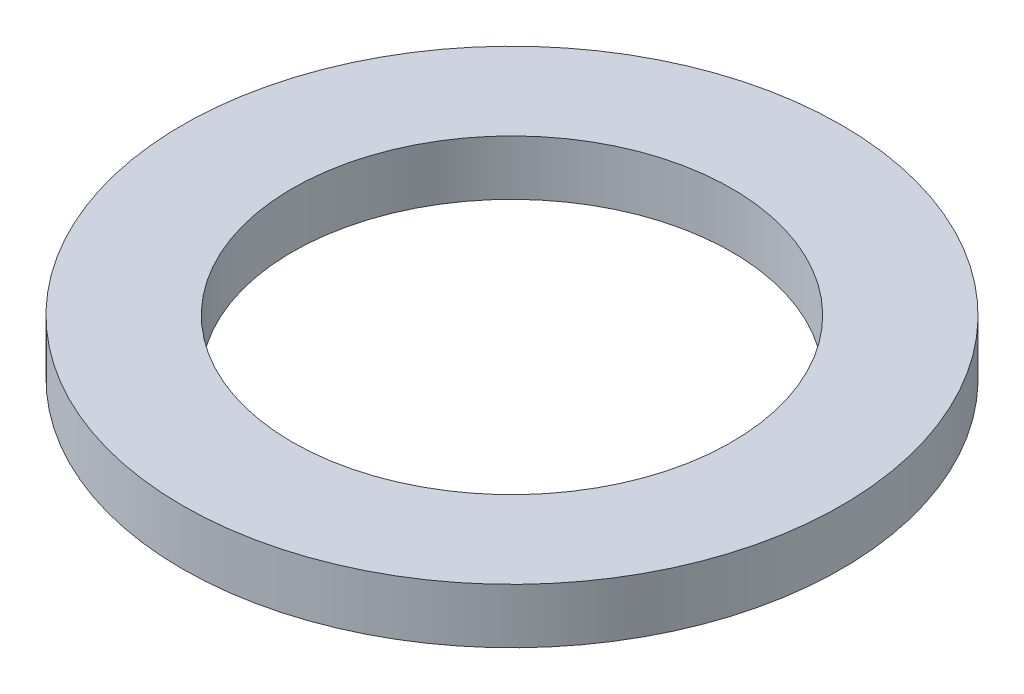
from build123d import *

# Parameters (mm, degrees)
SKETCH_1_R      = 30
SKETCH_1_R_2    = 20
EXTRUDE_1_DEPTH = 5


with BuildPart() as part:
    # Sketch 1 → Extrude 1 (new body)
    with BuildSketch(Plane(origin=(0, 0, 0), x_dir=(1, 0, 0), z_dir=(0, 1, 0))):
        with Locations(Location((0, 0, 0), (0, 0, 270))):
            Circle(SKETCH_1_R)
        with Locations(Location((0, 0, 0), (0, 0, 270))):
            Circle(SKETCH_1_R_2, mode=Mode.SUBTRACT)
    extrude(amount=EXTRUDE_1_DEPTH)


solid = part.part
